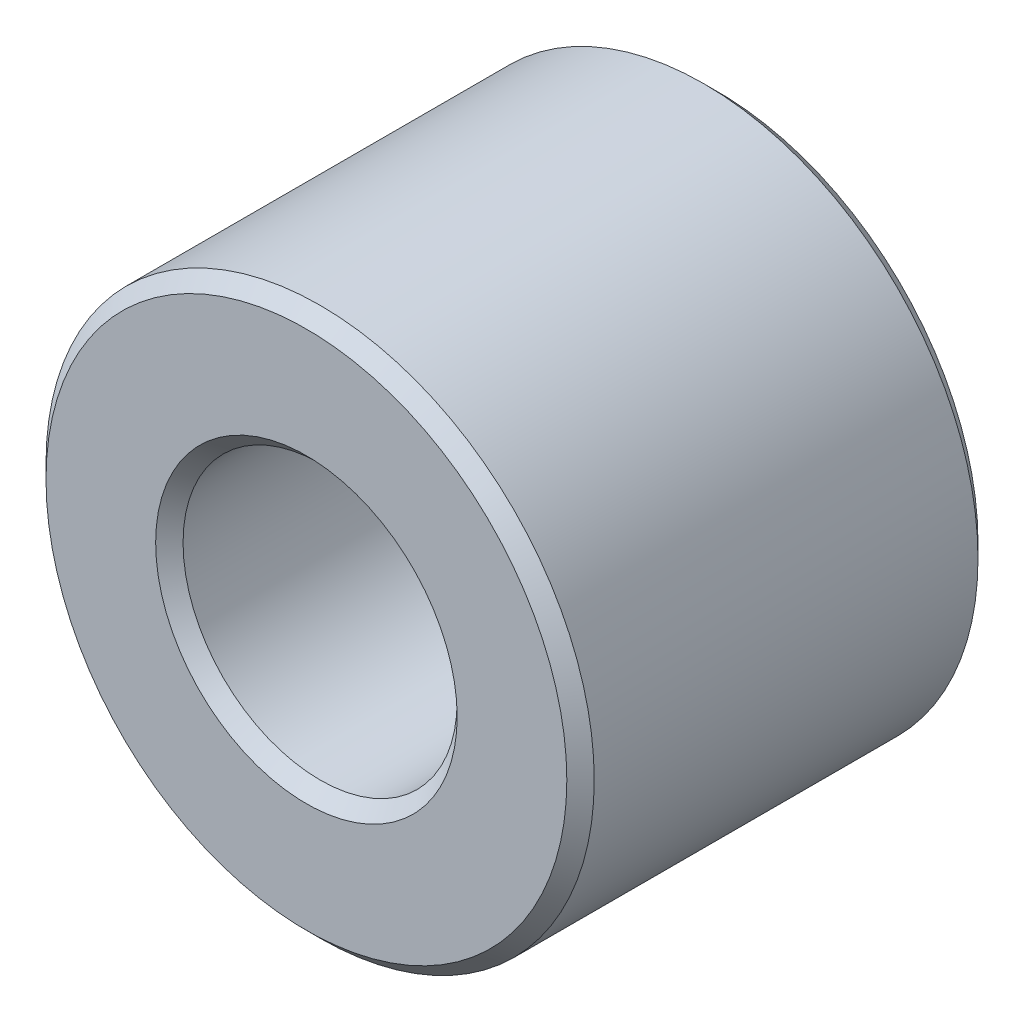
ISO-10303-21;
HEADER;
FILE_DESCRIPTION(('STEP AP214'),'2;1');
FILE_NAME('part.step','',(''),(''),'','','');
FILE_SCHEMA(('AUTOMOTIVE_DESIGN { 1 0 10303 214 1 1 1 1 }'));
ENDSEC;
DATA;
#1=APPLICATION_CONTEXT('core data for automotive mechanical design processes');
#2=APPLICATION_PROTOCOL_DEFINITION('international standard','automotive_design',2000,#1);
#3=PRODUCT_CONTEXT('',#1,'mechanical');
#4=PRODUCT('Part','Part','',(#3));
#5=PRODUCT_RELATED_PRODUCT_CATEGORY('part','',(#4));
#6=PRODUCT_DEFINITION_FORMATION('','',#4);
#7=PRODUCT_DEFINITION_CONTEXT('part definition',#1,'design');
#8=PRODUCT_DEFINITION('design','',#6,#7);
#9=PRODUCT_DEFINITION_SHAPE('','',#8);
#10=(LENGTH_UNIT() NAMED_UNIT(*) SI_UNIT(.MILLI.,.METRE.));
#11=(NAMED_UNIT(*) PLANE_ANGLE_UNIT() SI_UNIT($,.RADIAN.));
#12=(NAMED_UNIT(*) SI_UNIT($,.STERADIAN.) SOLID_ANGLE_UNIT());
#13=UNCERTAINTY_MEASURE_WITH_UNIT(LENGTH_MEASURE(1.E-05),#10,'distance_accuracy_value','');
#14=(GEOMETRIC_REPRESENTATION_CONTEXT(3) GLOBAL_UNCERTAINTY_ASSIGNED_CONTEXT((#13)) GLOBAL_UNIT_ASSIGNED_CONTEXT((#10,
#11,#12)) REPRESENTATION_CONTEXT('',''));
#15=CARTESIAN_POINT('',(0.,0.,0.));
#16=DIRECTION('',(0.,0.,1.));
#17=DIRECTION('',(1.,0.,0.));
#18=AXIS2_PLACEMENT_3D('',#15,#16,#17);
#19=CARTESIAN_POINT('',(0.,0.,22.5));
#20=DIRECTION('',(0.,0.,1.));
#21=DIRECTION('',(1.,0.,0.));
#22=AXIS2_PLACEMENT_3D('',#19,#20,#21);
#23=PLANE('',#22);
#24=CARTESIAN_POINT('',(0.,0.,22.5));
#25=DIRECTION('',(0.,0.,1.));
#26=DIRECTION('',(1.,0.,0.));
#27=AXIS2_PLACEMENT_3D('',#24,#25,#26);
#28=CIRCLE('',#27,16.5000000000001);
#29=CARTESIAN_POINT('',(16.5000000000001,0.,22.5));
#30=VERTEX_POINT('',#29);
#31=EDGE_CURVE('E10',#30,#30,#28,.F.);
#32=ORIENTED_EDGE('',*,*,#31,.T.);
#33=EDGE_LOOP('',(#32));
#34=FACE_BOUND('',#33,.T.);
#35=CARTESIAN_POINT('',(0.,0.,22.5));
#36=DIRECTION('',(0.,0.,1.));
#37=DIRECTION('',(1.,0.,0.));
#38=AXIS2_PLACEMENT_3D('',#35,#36,#37);
#39=CIRCLE('',#38,28.5000000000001);
#40=CARTESIAN_POINT('',(28.5000000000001,0.,22.5));
#41=VERTEX_POINT('',#40);
#42=EDGE_CURVE('E40',#41,#41,#39,.T.);
#43=ORIENTED_EDGE('',*,*,#42,.T.);
#44=EDGE_LOOP('',(#43));
#45=FACE_BOUND('',#44,.T.);
#46=ADVANCED_FACE('F33',(#34,#45),#23,.T.);
#47=CARTESIAN_POINT('',(0.,0.,-22.5));
#48=DIRECTION('',(0.,0.,1.));
#49=DIRECTION('',(1.,0.,0.));
#50=AXIS2_PLACEMENT_3D('',#47,#48,#49);
#51=PLANE('',#50);
#52=CARTESIAN_POINT('',(0.,0.,-22.5));
#53=DIRECTION('',(0.,0.,1.));
#54=DIRECTION('',(1.,0.,0.));
#55=AXIS2_PLACEMENT_3D('',#52,#53,#54);
#56=CIRCLE('',#55,16.5);
#57=CARTESIAN_POINT('',(16.5,0.,-22.5));
#58=VERTEX_POINT('',#57);
#59=EDGE_CURVE('E59',#58,#58,#56,.T.);
#60=ORIENTED_EDGE('',*,*,#59,.T.);
#61=EDGE_LOOP('',(#60));
#62=FACE_BOUND('',#61,.T.);
#63=CARTESIAN_POINT('',(0.,0.,-22.5));
#64=DIRECTION('',(0.,0.,1.));
#65=DIRECTION('',(1.,0.,0.));
#66=AXIS2_PLACEMENT_3D('',#63,#64,#65);
#67=CIRCLE('',#66,28.5);
#68=CARTESIAN_POINT('',(28.5,0.,-22.5));
#69=VERTEX_POINT('',#68);
#70=EDGE_CURVE('E62',#69,#69,#67,.F.);
#71=ORIENTED_EDGE('',*,*,#70,.T.);
#72=EDGE_LOOP('',(#71));
#73=FACE_BOUND('',#72,.T.);
#74=ADVANCED_FACE('F66',(#62,#73),#51,.F.);
#75=CARTESIAN_POINT('',(0.,0.,22.5));
#76=DIRECTION('',(0.,0.,-1.));
#77=DIRECTION('',(-1.,0.,0.));
#78=AXIS2_PLACEMENT_3D('',#75,#76,#77);
#79=CYLINDRICAL_SURFACE('',#78,30.);
#80=CARTESIAN_POINT('',(0.,0.,-21.));
#81=DIRECTION('',(0.,0.,1.));
#82=DIRECTION('',(1.,0.,0.));
#83=AXIS2_PLACEMENT_3D('',#80,#81,#82);
#84=CIRCLE('',#83,30.);
#85=CARTESIAN_POINT('',(-30.,0.,-21.));
#86=VERTEX_POINT('',#85);
#87=EDGE_CURVE('E44',#86,#86,#84,.T.);
#88=CARTESIAN_POINT('',(0.,0.,21.0000000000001));
#89=DIRECTION('',(0.,0.,1.));
#90=DIRECTION('',(1.,0.,0.));
#91=AXIS2_PLACEMENT_3D('',#88,#89,#90);
#92=CIRCLE('',#91,30.);
#93=CARTESIAN_POINT('',(-30.,0.,21.0000000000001));
#94=VERTEX_POINT('',#93);
#95=EDGE_CURVE('E48',#94,#94,#92,.F.);
#96=CARTESIAN_POINT('',(-30.,0.,-21.));
#97=CARTESIAN_POINT('',(-30.,0.,-20.5625));
#98=CARTESIAN_POINT('',(-30.,0.,-20.125));
#99=CARTESIAN_POINT('',(-30.,0.,-19.25));
#100=CARTESIAN_POINT('',(-30.,0.,-18.8125));
#101=CARTESIAN_POINT('',(-30.,0.,-17.9375));
#102=CARTESIAN_POINT('',(-30.,0.,-17.5));
#103=CARTESIAN_POINT('',(-30.,0.,-16.625));
#104=CARTESIAN_POINT('',(-30.,0.,-16.1875));
#105=CARTESIAN_POINT('',(-30.,0.,-15.3125));
#106=CARTESIAN_POINT('',(-30.,0.,-14.875));
#107=CARTESIAN_POINT('',(-30.,0.,-14.));
#108=CARTESIAN_POINT('',(-30.,0.,-13.5625));
#109=CARTESIAN_POINT('',(-30.,0.,-12.6875));
#110=CARTESIAN_POINT('',(-30.,0.,-12.25));
#111=CARTESIAN_POINT('',(-30.,0.,-11.375));
#112=CARTESIAN_POINT('',(-30.,0.,-10.9375));
#113=CARTESIAN_POINT('',(-30.,0.,-10.0625));
#114=CARTESIAN_POINT('',(-30.,0.,-9.62499999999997));
#115=CARTESIAN_POINT('',(-30.,0.,-8.74999999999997));
#116=CARTESIAN_POINT('',(-30.,0.,-8.31249999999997));
#117=CARTESIAN_POINT('',(-30.,0.,-7.43749999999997));
#118=CARTESIAN_POINT('',(-30.,0.,-6.99999999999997));
#119=CARTESIAN_POINT('',(-30.,0.,-6.12499999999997));
#120=CARTESIAN_POINT('',(-30.,0.,-5.68749999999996));
#121=CARTESIAN_POINT('',(-30.,0.,-4.81249999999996));
#122=CARTESIAN_POINT('',(-30.,0.,-4.37499999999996));
#123=CARTESIAN_POINT('',(-30.,0.,-3.49999999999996));
#124=CARTESIAN_POINT('',(-30.,0.,-3.06249999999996));
#125=CARTESIAN_POINT('',(-30.,0.,-2.18749999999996));
#126=CARTESIAN_POINT('',(-30.,0.,-1.74999999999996));
#127=CARTESIAN_POINT('',(-30.,0.,-0.874999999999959));
#128=CARTESIAN_POINT('',(-30.,0.,-0.437499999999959));
#129=CARTESIAN_POINT('',(-30.,0.,0.437500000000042));
#130=CARTESIAN_POINT('',(-30.,0.,0.875000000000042));
#131=CARTESIAN_POINT('',(-30.,0.,1.75000000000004));
#132=CARTESIAN_POINT('',(-30.,0.,2.18750000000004));
#133=CARTESIAN_POINT('',(-30.,0.,3.06250000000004));
#134=CARTESIAN_POINT('',(-30.,0.,3.50000000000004));
#135=CARTESIAN_POINT('',(-30.,0.,4.37500000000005));
#136=CARTESIAN_POINT('',(-30.,0.,4.81250000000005));
#137=CARTESIAN_POINT('',(-30.,0.,5.68750000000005));
#138=CARTESIAN_POINT('',(-30.,0.,6.12500000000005));
#139=CARTESIAN_POINT('',(-30.,0.,7.00000000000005));
#140=CARTESIAN_POINT('',(-30.,0.,7.43750000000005));
#141=CARTESIAN_POINT('',(-30.,0.,8.31250000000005));
#142=CARTESIAN_POINT('',(-30.,0.,8.75000000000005));
#143=CARTESIAN_POINT('',(-30.,0.,9.62500000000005));
#144=CARTESIAN_POINT('',(-30.,0.,10.0625));
#145=CARTESIAN_POINT('',(-30.,0.,10.9375000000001));
#146=CARTESIAN_POINT('',(-30.,0.,11.3750000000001));
#147=CARTESIAN_POINT('',(-30.,0.,12.2500000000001));
#148=CARTESIAN_POINT('',(-30.,0.,12.6875000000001));
#149=CARTESIAN_POINT('',(-30.,0.,13.5625000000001));
#150=CARTESIAN_POINT('',(-30.,0.,14.0000000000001));
#151=CARTESIAN_POINT('',(-30.,0.,14.8750000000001));
#152=CARTESIAN_POINT('',(-30.,0.,15.3125000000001));
#153=CARTESIAN_POINT('',(-30.,0.,16.1875000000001));
#154=CARTESIAN_POINT('',(-30.,0.,16.6250000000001));
#155=CARTESIAN_POINT('',(-30.,0.,17.5000000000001));
#156=CARTESIAN_POINT('',(-30.,0.,17.9375000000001));
#157=CARTESIAN_POINT('',(-30.,0.,18.8125000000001));
#158=CARTESIAN_POINT('',(-30.,0.,19.2500000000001));
#159=CARTESIAN_POINT('',(-30.,0.,20.1250000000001));
#160=CARTESIAN_POINT('',(-30.,0.,20.5625000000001));
#161=CARTESIAN_POINT('',(-30.,0.,21.0000000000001));
#162=B_SPLINE_CURVE_WITH_KNOTS('',3,(#96,#97,#98,#99,#100,#101,#102,#103,#104,#105,#106,#107,
#108,#109,#110,#111,#112,#113,#114,#115,#116,#117,#118,#119,#120,#121,#122,#123,#124,#125,#126,
#127,#128,#129,#130,#131,#132,#133,#134,#135,#136,#137,#138,#139,#140,#141,#142,#143,#144,#145,
#146,#147,#148,#149,#150,#151,#152,#153,#154,#155,#156,#157,#158,#159,#160,#161),.UNSPECIFIED.,
.F.,.F.,(4,2,2,2,2,2,2,2,2,2,2,2,2,2,2,2,2,2,2,2,2,2,2,2,2,2,2,2,2,2,2,2,4),(0.,1.3125,2.625,
3.9375,5.25,6.56250000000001,7.87500000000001,9.18750000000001,10.5,11.8125,13.125,14.4375,
15.75,17.0625,18.375,19.6875,21.,22.3125,23.625,24.9375,26.25,27.5625,28.875,30.1875,31.5,
32.8125,34.125,35.4375,36.75,38.0625,39.375,40.6875,42.),.UNSPECIFIED.);
#163=EDGE_CURVE('BSEAM76',#86,#94,#162,.T.);
#164=ORIENTED_EDGE('',*,*,#87,.T.);
#165=ORIENTED_EDGE('',*,*,#95,.T.);
#166=ORIENTED_EDGE('',*,*,#163,.T.);
#167=ORIENTED_EDGE('',*,*,#163,.F.);
#168=EDGE_LOOP('',(#164,#166,#165,#167));
#169=FACE_BOUND('',#168,.T.);
#170=ADVANCED_FACE('F76',(#169),#79,.T.);
#171=CARTESIAN_POINT('',(0.,0.,22.5));
#172=DIRECTION('',(0.,0.,-1.));
#173=DIRECTION('',(-1.,0.,0.));
#174=AXIS2_PLACEMENT_3D('',#171,#172,#173);
#175=CYLINDRICAL_SURFACE('',#174,15.);
#176=CARTESIAN_POINT('',(0.,0.,-21.));
#177=DIRECTION('',(0.,0.,1.));
#178=DIRECTION('',(1.,0.,0.));
#179=AXIS2_PLACEMENT_3D('',#176,#177,#178);
#180=CIRCLE('',#179,15.);
#181=CARTESIAN_POINT('',(-15.,0.,-21.));
#182=VERTEX_POINT('',#181);
#183=EDGE_CURVE('E53',#182,#182,#180,.F.);
#184=CARTESIAN_POINT('',(0.,0.,21.));
#185=DIRECTION('',(0.,0.,1.));
#186=DIRECTION('',(1.,0.,0.));
#187=AXIS2_PLACEMENT_3D('',#184,#185,#186);
#188=CIRCLE('',#187,15.);
#189=CARTESIAN_POINT('',(-15.,0.,21.));
#190=VERTEX_POINT('',#189);
#191=EDGE_CURVE('E56',#190,#190,#188,.T.);
#192=CARTESIAN_POINT('',(-15.,0.,-21.));
#193=CARTESIAN_POINT('',(-15.,0.,-20.5625));
#194=CARTESIAN_POINT('',(-15.,0.,-20.125));
#195=CARTESIAN_POINT('',(-15.,0.,-19.25));
#196=CARTESIAN_POINT('',(-15.,0.,-18.8125));
#197=CARTESIAN_POINT('',(-15.,0.,-17.9375));
#198=CARTESIAN_POINT('',(-15.,0.,-17.5));
#199=CARTESIAN_POINT('',(-15.,0.,-16.625));
#200=CARTESIAN_POINT('',(-15.,0.,-16.1875));
#201=CARTESIAN_POINT('',(-15.,0.,-15.3125));
#202=CARTESIAN_POINT('',(-15.,0.,-14.875));
#203=CARTESIAN_POINT('',(-15.,0.,-14.));
#204=CARTESIAN_POINT('',(-15.,0.,-13.5625));
#205=CARTESIAN_POINT('',(-15.,0.,-12.6875));
#206=CARTESIAN_POINT('',(-15.,0.,-12.25));
#207=CARTESIAN_POINT('',(-15.,0.,-11.375));
#208=CARTESIAN_POINT('',(-15.,0.,-10.9375));
#209=CARTESIAN_POINT('',(-15.,0.,-10.0625));
#210=CARTESIAN_POINT('',(-15.,0.,-9.62500000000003));
#211=CARTESIAN_POINT('',(-15.,0.,-8.75000000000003));
#212=CARTESIAN_POINT('',(-15.,0.,-8.31250000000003));
#213=CARTESIAN_POINT('',(-15.,0.,-7.43750000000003));
#214=CARTESIAN_POINT('',(-15.,0.,-7.00000000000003));
#215=CARTESIAN_POINT('',(-15.,0.,-6.12500000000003));
#216=CARTESIAN_POINT('',(-15.,0.,-5.68750000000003));
#217=CARTESIAN_POINT('',(-15.,0.,-4.81250000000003));
#218=CARTESIAN_POINT('',(-15.,0.,-4.37500000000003));
#219=CARTESIAN_POINT('',(-15.,0.,-3.50000000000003));
#220=CARTESIAN_POINT('',(-15.,0.,-3.06250000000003));
#221=CARTESIAN_POINT('',(-15.,0.,-2.18750000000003));
#222=CARTESIAN_POINT('',(-15.,0.,-1.75000000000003));
#223=CARTESIAN_POINT('',(-15.,0.,-0.875000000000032));
#224=CARTESIAN_POINT('',(-15.,0.,-0.437500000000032));
#225=CARTESIAN_POINT('',(-15.,0.,0.437499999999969));
#226=CARTESIAN_POINT('',(-15.,0.,0.87499999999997));
#227=CARTESIAN_POINT('',(-15.,0.,1.74999999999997));
#228=CARTESIAN_POINT('',(-15.,0.,2.18749999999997));
#229=CARTESIAN_POINT('',(-15.,0.,3.06249999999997));
#230=CARTESIAN_POINT('',(-15.,0.,3.49999999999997));
#231=CARTESIAN_POINT('',(-15.,0.,4.37499999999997));
#232=CARTESIAN_POINT('',(-15.,0.,4.81249999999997));
#233=CARTESIAN_POINT('',(-15.,0.,5.68749999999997));
#234=CARTESIAN_POINT('',(-15.,0.,6.12499999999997));
#235=CARTESIAN_POINT('',(-15.,0.,6.99999999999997));
#236=CARTESIAN_POINT('',(-15.,0.,7.43749999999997));
#237=CARTESIAN_POINT('',(-15.,0.,8.31249999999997));
#238=CARTESIAN_POINT('',(-15.,0.,8.74999999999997));
#239=CARTESIAN_POINT('',(-15.,0.,9.62499999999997));
#240=CARTESIAN_POINT('',(-15.,0.,10.0625));
#241=CARTESIAN_POINT('',(-15.,0.,10.9375));
#242=CARTESIAN_POINT('',(-15.,0.,11.375));
#243=CARTESIAN_POINT('',(-15.,0.,12.25));
#244=CARTESIAN_POINT('',(-15.,0.,12.6875));
#245=CARTESIAN_POINT('',(-15.,0.,13.5625));
#246=CARTESIAN_POINT('',(-15.,0.,14.));
#247=CARTESIAN_POINT('',(-15.,0.,14.875));
#248=CARTESIAN_POINT('',(-15.,0.,15.3125));
#249=CARTESIAN_POINT('',(-15.,0.,16.1875));
#250=CARTESIAN_POINT('',(-15.,0.,16.625));
#251=CARTESIAN_POINT('',(-15.,0.,17.5));
#252=CARTESIAN_POINT('',(-15.,0.,17.9375));
#253=CARTESIAN_POINT('',(-15.,0.,18.8125));
#254=CARTESIAN_POINT('',(-15.,0.,19.25));
#255=CARTESIAN_POINT('',(-15.,0.,20.125));
#256=CARTESIAN_POINT('',(-15.,0.,20.5625));
#257=CARTESIAN_POINT('',(-15.,0.,21.));
#258=B_SPLINE_CURVE_WITH_KNOTS('',3,(#192,#193,#194,#195,#196,#197,#198,#199,#200,#201,#202,
#203,#204,#205,#206,#207,#208,#209,#210,#211,#212,#213,#214,#215,#216,#217,#218,#219,#220,#221,
#222,#223,#224,#225,#226,#227,#228,#229,#230,#231,#232,#233,#234,#235,#236,#237,#238,#239,#240,
#241,#242,#243,#244,#245,#246,#247,#248,#249,#250,#251,#252,#253,#254,#255,#256,#257),
.UNSPECIFIED.,.F.,.F.,(4,2,2,2,2,2,2,2,2,2,2,2,2,2,2,2,2,2,2,2,2,2,2,2,2,2,2,2,2,2,2,2,4),(0.,
1.3125,2.625,3.9375,5.25,6.5625,7.875,9.1875,10.5,11.8125,13.125,14.4375,15.75,17.0625,18.375,
19.6875,21.,22.3125,23.625,24.9375,26.25,27.5625,28.875,30.1875,31.5,32.8125,34.125,35.4375,
36.75,38.0625,39.375,40.6875,42.),.UNSPECIFIED.);
#259=EDGE_CURVE('BSEAM79',#182,#190,#258,.T.);
#260=ORIENTED_EDGE('',*,*,#183,.T.);
#261=ORIENTED_EDGE('',*,*,#191,.T.);
#262=ORIENTED_EDGE('',*,*,#259,.T.);
#263=ORIENTED_EDGE('',*,*,#259,.F.);
#264=EDGE_LOOP('',(#260,#262,#261,#263));
#265=FACE_BOUND('',#264,.T.);
#266=ADVANCED_FACE('F79',(#265),#175,.F.);
#267=CARTESIAN_POINT('',(0.,0.,-22.5));
#268=DIRECTION('',(0.,0.,-1.));
#269=DIRECTION('',(-1.,0.,0.));
#270=AXIS2_PLACEMENT_3D('',#267,#268,#269);
#271=CONICAL_SURFACE('',#270,16.5,0.785398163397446);
#272=ORIENTED_EDGE('',*,*,#183,.F.);
#273=EDGE_LOOP('',(#272));
#274=FACE_BOUND('',#273,.T.);
#275=ORIENTED_EDGE('',*,*,#59,.F.);
#276=EDGE_LOOP('',(#275));
#277=FACE_BOUND('',#276,.T.);
#278=ADVANCED_FACE('F72',(#274,#277),#271,.F.);
#279=CARTESIAN_POINT('',(0.,0.,-21.));
#280=DIRECTION('',(0.,0.,1.));
#281=DIRECTION('',(1.,0.,0.));
#282=AXIS2_PLACEMENT_3D('',#279,#280,#281);
#283=CONICAL_SURFACE('',#282,30.,0.785398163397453);
#284=ORIENTED_EDGE('',*,*,#70,.F.);
#285=EDGE_LOOP('',(#284));
#286=FACE_BOUND('',#285,.T.);
#287=ORIENTED_EDGE('',*,*,#87,.F.);
#288=EDGE_LOOP('',(#287));
#289=FACE_BOUND('',#288,.T.);
#290=ADVANCED_FACE('F68',(#286,#289),#283,.T.);
#291=CARTESIAN_POINT('',(0.,0.,21.));
#292=DIRECTION('',(0.,0.,1.));
#293=DIRECTION('',(1.,0.,0.));
#294=AXIS2_PLACEMENT_3D('',#291,#292,#293);
#295=CONICAL_SURFACE('',#294,15.,0.785398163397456);
#296=ORIENTED_EDGE('',*,*,#31,.F.);
#297=EDGE_LOOP('',(#296));
#298=FACE_BOUND('',#297,.T.);
#299=ORIENTED_EDGE('',*,*,#191,.F.);
#300=EDGE_LOOP('',(#299));
#301=FACE_BOUND('',#300,.T.);
#302=ADVANCED_FACE('F71',(#298,#301),#295,.F.);
#303=CARTESIAN_POINT('',(0.,0.,22.5));
#304=DIRECTION('',(0.,0.,-1.));
#305=DIRECTION('',(-1.,0.,0.));
#306=AXIS2_PLACEMENT_3D('',#303,#304,#305);
#307=CONICAL_SURFACE('',#306,28.5000000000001,0.785398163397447);
#308=ORIENTED_EDGE('',*,*,#95,.F.);
#309=EDGE_LOOP('',(#308));
#310=FACE_BOUND('',#309,.T.);
#311=ORIENTED_EDGE('',*,*,#42,.F.);
#312=EDGE_LOOP('',(#311));
#313=FACE_BOUND('',#312,.T.);
#314=ADVANCED_FACE('F35',(#310,#313),#307,.T.);
#315=CLOSED_SHELL('',(#46,#74,#170,#266,#278,#290,#302,#314));
#316=MANIFOLD_SOLID_BREP('B2',#315);
#317=ADVANCED_BREP_SHAPE_REPRESENTATION('',(#18,#316),#14);
#318=SHAPE_DEFINITION_REPRESENTATION(#9,#317);
ENDSEC;
END-ISO-10303-21;
